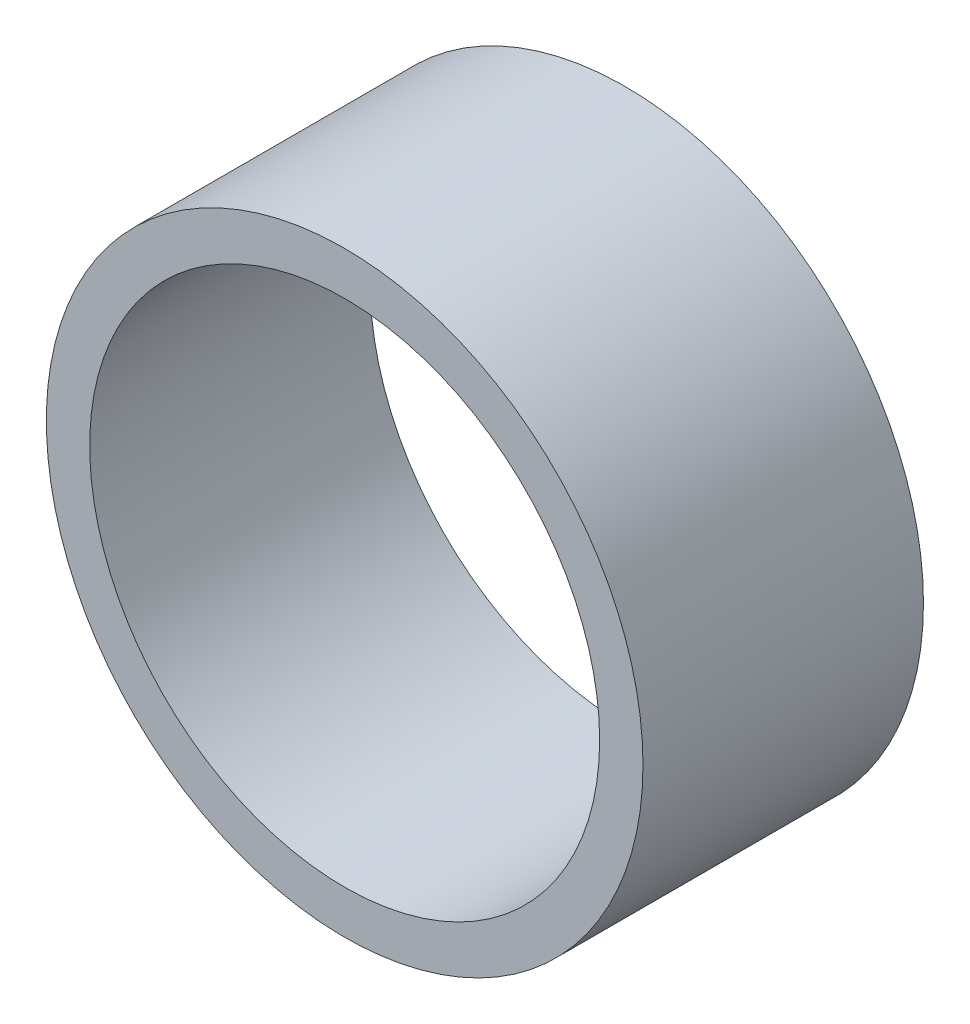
ISO-10303-21;
HEADER;
FILE_DESCRIPTION(('STEP AP214'),'2;1');
FILE_NAME('part.step','',(''),(''),'','','');
FILE_SCHEMA(('AUTOMOTIVE_DESIGN { 1 0 10303 214 1 1 1 1 }'));
ENDSEC;
DATA;
#1=APPLICATION_CONTEXT('core data for automotive mechanical design processes');
#2=APPLICATION_PROTOCOL_DEFINITION('international standard','automotive_design',2000,#1);
#3=PRODUCT_CONTEXT('',#1,'mechanical');
#4=PRODUCT('Part','Part','',(#3));
#5=PRODUCT_RELATED_PRODUCT_CATEGORY('part','',(#4));
#6=PRODUCT_DEFINITION_FORMATION('','',#4);
#7=PRODUCT_DEFINITION_CONTEXT('part definition',#1,'design');
#8=PRODUCT_DEFINITION('design','',#6,#7);
#9=PRODUCT_DEFINITION_SHAPE('','',#8);
#10=(LENGTH_UNIT() NAMED_UNIT(*) SI_UNIT(.MILLI.,.METRE.));
#11=(NAMED_UNIT(*) PLANE_ANGLE_UNIT() SI_UNIT($,.RADIAN.));
#12=(NAMED_UNIT(*) SI_UNIT($,.STERADIAN.) SOLID_ANGLE_UNIT());
#13=UNCERTAINTY_MEASURE_WITH_UNIT(LENGTH_MEASURE(1.E-05),#10,'distance_accuracy_value','');
#14=(GEOMETRIC_REPRESENTATION_CONTEXT(3) GLOBAL_UNCERTAINTY_ASSIGNED_CONTEXT((#13)) GLOBAL_UNIT_ASSIGNED_CONTEXT((#10,
#11,#12)) REPRESENTATION_CONTEXT('',''));
#15=CARTESIAN_POINT('',(0.,0.,0.));
#16=DIRECTION('',(0.,0.,1.));
#17=DIRECTION('',(1.,0.,0.));
#18=AXIS2_PLACEMENT_3D('',#15,#16,#17);
#19=CARTESIAN_POINT('',(0.,0.,22.));
#20=DIRECTION('',(0.,0.,1.));
#21=DIRECTION('',(1.,0.,0.));
#22=AXIS2_PLACEMENT_3D('',#19,#20,#21);
#23=PLANE('',#22);
#24=CARTESIAN_POINT('',(0.,0.,22.));
#25=DIRECTION('',(0.,0.,1.));
#26=DIRECTION('',(1.,0.,0.));
#27=AXIS2_PLACEMENT_3D('',#24,#25,#26);
#28=CIRCLE('',#27,23.4);
#29=CARTESIAN_POINT('',(23.4,0.,22.));
#30=VERTEX_POINT('',#29);
#31=EDGE_CURVE('E10',#30,#30,#28,.T.);
#32=ORIENTED_EDGE('',*,*,#31,.T.);
#33=EDGE_LOOP('',(#32));
#34=FACE_BOUND('',#33,.T.);
#35=CARTESIAN_POINT('',(0.,0.,22.));
#36=DIRECTION('',(0.,0.,1.));
#37=DIRECTION('',(1.,0.,0.));
#38=AXIS2_PLACEMENT_3D('',#35,#36,#37);
#39=CIRCLE('',#38,20.);
#40=CARTESIAN_POINT('',(20.,0.,22.));
#41=VERTEX_POINT('',#40);
#42=EDGE_CURVE('E40',#41,#41,#39,.T.);
#43=ORIENTED_EDGE('',*,*,#42,.F.);
#44=EDGE_LOOP('',(#43));
#45=FACE_BOUND('',#44,.T.);
#46=ADVANCED_FACE('F29',(#34,#45),#23,.T.);
#47=CARTESIAN_POINT('',(0.,0.,0.));
#48=DIRECTION('',(0.,0.,1.));
#49=DIRECTION('',(1.,0.,0.));
#50=AXIS2_PLACEMENT_3D('',#47,#48,#49);
#51=PLANE('',#50);
#52=CARTESIAN_POINT('',(0.,0.,0.));
#53=DIRECTION('',(0.,0.,1.));
#54=DIRECTION('',(1.,0.,0.));
#55=AXIS2_PLACEMENT_3D('',#52,#53,#54);
#56=CIRCLE('',#55,23.4);
#57=CARTESIAN_POINT('',(23.4,0.,0.));
#58=VERTEX_POINT('',#57);
#59=EDGE_CURVE('E36',#58,#58,#56,.T.);
#60=ORIENTED_EDGE('',*,*,#59,.F.);
#61=EDGE_LOOP('',(#60));
#62=FACE_BOUND('',#61,.T.);
#63=CARTESIAN_POINT('',(0.,0.,0.));
#64=DIRECTION('',(0.,0.,1.));
#65=DIRECTION('',(1.,0.,0.));
#66=AXIS2_PLACEMENT_3D('',#63,#64,#65);
#67=CIRCLE('',#66,20.);
#68=CARTESIAN_POINT('',(20.,0.,0.));
#69=VERTEX_POINT('',#68);
#70=EDGE_CURVE('E44',#69,#69,#67,.T.);
#71=ORIENTED_EDGE('',*,*,#70,.T.);
#72=EDGE_LOOP('',(#71));
#73=FACE_BOUND('',#72,.T.);
#74=ADVANCED_FACE('F50',(#62,#73),#51,.F.);
#75=CARTESIAN_POINT('',(0.,0.,22.));
#76=DIRECTION('',(0.,0.,-1.));
#77=DIRECTION('',(-1.,0.,0.));
#78=AXIS2_PLACEMENT_3D('',#75,#76,#77);
#79=CYLINDRICAL_SURFACE('',#78,23.4);
#80=ORIENTED_EDGE('',*,*,#31,.F.);
#81=EDGE_LOOP('',(#80));
#82=FACE_BOUND('',#81,.T.);
#83=ORIENTED_EDGE('',*,*,#59,.T.);
#84=EDGE_LOOP('',(#83));
#85=FACE_BOUND('',#84,.T.);
#86=ADVANCED_FACE('F31',(#82,#85),#79,.T.);
#87=CARTESIAN_POINT('',(0.,0.,22.));
#88=DIRECTION('',(0.,0.,-1.));
#89=DIRECTION('',(-1.,0.,0.));
#90=AXIS2_PLACEMENT_3D('',#87,#88,#89);
#91=CYLINDRICAL_SURFACE('',#90,20.);
#92=ORIENTED_EDGE('',*,*,#42,.T.);
#93=EDGE_LOOP('',(#92));
#94=FACE_BOUND('',#93,.T.);
#95=ORIENTED_EDGE('',*,*,#70,.F.);
#96=EDGE_LOOP('',(#95));
#97=FACE_BOUND('',#96,.T.);
#98=ADVANCED_FACE('F52',(#94,#97),#91,.F.);
#99=CLOSED_SHELL('',(#46,#74,#86,#98));
#100=MANIFOLD_SOLID_BREP('B2',#99);
#101=ADVANCED_BREP_SHAPE_REPRESENTATION('',(#18,#100),#14);
#102=SHAPE_DEFINITION_REPRESENTATION(#9,#101);
ENDSEC;
END-ISO-10303-21;
